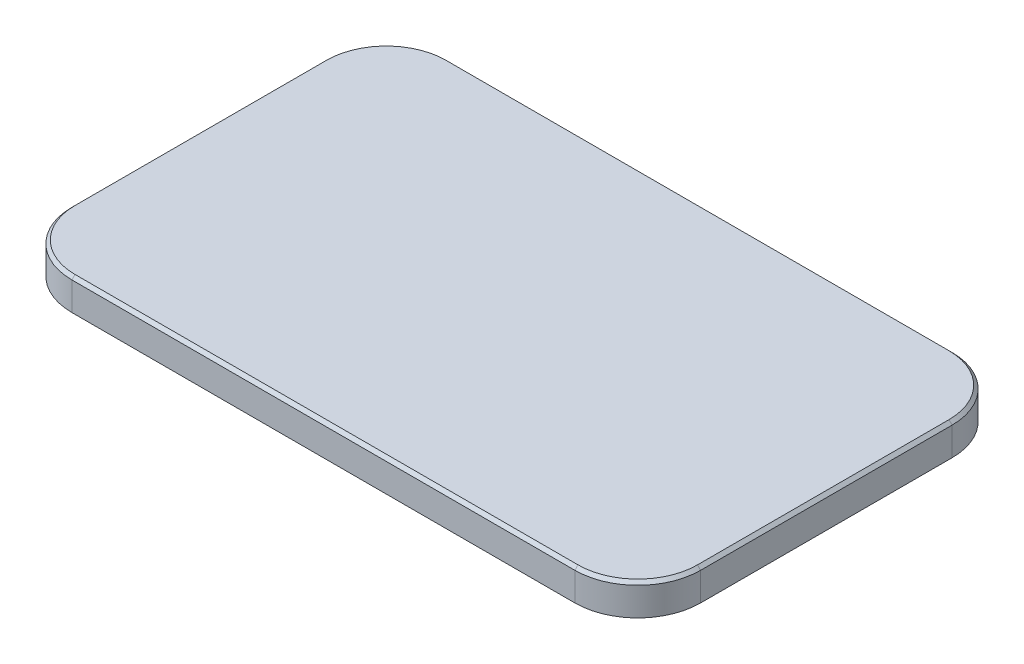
ISO-10303-21;
HEADER;
FILE_DESCRIPTION(('STEP AP214'),'2;1');
FILE_NAME('part.step','',(''),(''),'','','');
FILE_SCHEMA(('AUTOMOTIVE_DESIGN { 1 0 10303 214 1 1 1 1 }'));
ENDSEC;
DATA;
#1=APPLICATION_CONTEXT('core data for automotive mechanical design processes');
#2=APPLICATION_PROTOCOL_DEFINITION('international standard','automotive_design',2000,#1);
#3=PRODUCT_CONTEXT('',#1,'mechanical');
#4=PRODUCT('Part','Part','',(#3));
#5=PRODUCT_RELATED_PRODUCT_CATEGORY('part','',(#4));
#6=PRODUCT_DEFINITION_FORMATION('','',#4);
#7=PRODUCT_DEFINITION_CONTEXT('part definition',#1,'design');
#8=PRODUCT_DEFINITION('design','',#6,#7);
#9=PRODUCT_DEFINITION_SHAPE('','',#8);
#10=(LENGTH_UNIT() NAMED_UNIT(*) SI_UNIT(.MILLI.,.METRE.));
#11=(NAMED_UNIT(*) PLANE_ANGLE_UNIT() SI_UNIT($,.RADIAN.));
#12=(NAMED_UNIT(*) SI_UNIT($,.STERADIAN.) SOLID_ANGLE_UNIT());
#13=UNCERTAINTY_MEASURE_WITH_UNIT(LENGTH_MEASURE(1.E-05),#10,'distance_accuracy_value','');
#14=(GEOMETRIC_REPRESENTATION_CONTEXT(3) GLOBAL_UNCERTAINTY_ASSIGNED_CONTEXT((#13)) GLOBAL_UNIT_ASSIGNED_CONTEXT((#10,
#11,#12)) REPRESENTATION_CONTEXT('',''));
#15=CARTESIAN_POINT('',(0.,0.,0.));
#16=DIRECTION('',(0.,0.,1.));
#17=DIRECTION('',(1.,0.,0.));
#18=AXIS2_PLACEMENT_3D('',#15,#16,#17);
#19=CARTESIAN_POINT('',(-63.5,6.35,-38.1));
#20=DIRECTION('',(1.,0.,0.));
#21=DIRECTION('',(0.,0.,-1.));
#22=AXIS2_PLACEMENT_3D('',#19,#20,#21);
#23=PLANE('',#22);
#24=DIRECTION('',(0.,-1.,0.));
#25=VECTOR('',#24,1.);
#26=CARTESIAN_POINT('',(-63.5,6.35,25.4));
#27=LINE('',#26,#25);
#28=CARTESIAN_POINT('',(-63.5,0.,25.4));
#29=VERTEX_POINT('',#28);
#30=CARTESIAN_POINT('',(-63.5,5.715,25.4));
#31=VERTEX_POINT('',#30);
#32=EDGE_CURVE('E127',#29,#31,#27,.F.);
#33=ORIENTED_EDGE('',*,*,#32,.T.);
#34=DIRECTION('',(0.,0.,-1.));
#35=VECTOR('',#34,1.);
#36=CARTESIAN_POINT('',(-63.5,5.715,-25.4));
#37=LINE('',#36,#35);
#38=CARTESIAN_POINT('',(-63.5,5.715,-25.4));
#39=VERTEX_POINT('',#38);
#40=EDGE_CURVE('E55',#31,#39,#37,.T.);
#41=ORIENTED_EDGE('',*,*,#40,.T.);
#42=DIRECTION('',(0.,-1.,0.));
#43=VECTOR('',#42,1.);
#44=CARTESIAN_POINT('',(-63.5,6.35,-25.4));
#45=LINE('',#44,#43);
#46=CARTESIAN_POINT('',(-63.5,0.,-25.4));
#47=VERTEX_POINT('',#46);
#48=EDGE_CURVE('E120',#39,#47,#45,.T.);
#49=ORIENTED_EDGE('',*,*,#48,.T.);
#50=DIRECTION('',(0.,0.,1.));
#51=VECTOR('',#50,1.);
#52=CARTESIAN_POINT('',(-63.5,0.,-38.1));
#53=LINE('',#52,#51);
#54=EDGE_CURVE('E123',#47,#29,#53,.T.);
#55=ORIENTED_EDGE('',*,*,#54,.T.);
#56=EDGE_LOOP('',(#33,#41,#49,#55));
#57=FACE_BOUND('',#56,.T.);
#58=ADVANCED_FACE('F31',(#57),#23,.F.);
#59=CARTESIAN_POINT('',(-63.5,6.35,38.1));
#60=DIRECTION('',(0.,0.,-1.));
#61=DIRECTION('',(-1.,0.,0.));
#62=AXIS2_PLACEMENT_3D('',#59,#60,#61);
#63=PLANE('',#62);
#64=DIRECTION('',(0.,-1.,0.));
#65=VECTOR('',#64,1.);
#66=CARTESIAN_POINT('',(50.8,6.35,38.1));
#67=LINE('',#66,#65);
#68=CARTESIAN_POINT('',(50.8,0.,38.1));
#69=VERTEX_POINT('',#68);
#70=CARTESIAN_POINT('',(50.8,5.715,38.1));
#71=VERTEX_POINT('',#70);
#72=EDGE_CURVE('E165',#69,#71,#67,.F.);
#73=ORIENTED_EDGE('',*,*,#72,.T.);
#74=DIRECTION('',(-1.,0.,0.));
#75=VECTOR('',#74,1.);
#76=CARTESIAN_POINT('',(-50.8,5.715,38.1));
#77=LINE('',#76,#75);
#78=CARTESIAN_POINT('',(-50.8,5.715,38.1));
#79=VERTEX_POINT('',#78);
#80=EDGE_CURVE('E194',#71,#79,#77,.T.);
#81=ORIENTED_EDGE('',*,*,#80,.T.);
#82=DIRECTION('',(0.,-1.,0.));
#83=VECTOR('',#82,1.);
#84=CARTESIAN_POINT('',(-50.8,6.35,38.1));
#85=LINE('',#84,#83);
#86=CARTESIAN_POINT('',(-50.8,0.,38.1));
#87=VERTEX_POINT('',#86);
#88=EDGE_CURVE('E168',#79,#87,#85,.T.);
#89=ORIENTED_EDGE('',*,*,#88,.T.);
#90=DIRECTION('',(1.,0.,0.));
#91=VECTOR('',#90,1.);
#92=CARTESIAN_POINT('',(-63.5,0.,38.1));
#93=LINE('',#92,#91);
#94=EDGE_CURVE('E142',#87,#69,#93,.T.);
#95=ORIENTED_EDGE('',*,*,#94,.T.);
#96=EDGE_LOOP('',(#73,#81,#89,#95));
#97=FACE_BOUND('',#96,.T.);
#98=ADVANCED_FACE('F271',(#97),#63,.F.);
#99=CARTESIAN_POINT('',(63.5,6.35,-38.1));
#100=DIRECTION('',(-1.,0.,0.));
#101=DIRECTION('',(0.,0.,1.));
#102=AXIS2_PLACEMENT_3D('',#99,#100,#101);
#103=PLANE('',#102);
#104=DIRECTION('',(0.,-1.,0.));
#105=VECTOR('',#104,1.);
#106=CARTESIAN_POINT('',(63.5,6.35,-25.4));
#107=LINE('',#106,#105);
#108=CARTESIAN_POINT('',(63.5,0.,-25.4));
#109=VERTEX_POINT('',#108);
#110=CARTESIAN_POINT('',(63.5,5.715,-25.4));
#111=VERTEX_POINT('',#110);
#112=EDGE_CURVE('E162',#109,#111,#107,.F.);
#113=ORIENTED_EDGE('',*,*,#112,.T.);
#114=DIRECTION('',(0.,0.,1.));
#115=VECTOR('',#114,1.);
#116=CARTESIAN_POINT('',(63.5,5.715,25.4));
#117=LINE('',#116,#115);
#118=CARTESIAN_POINT('',(63.5,5.715,25.4));
#119=VERTEX_POINT('',#118);
#120=EDGE_CURVE('E190',#111,#119,#117,.T.);
#121=ORIENTED_EDGE('',*,*,#120,.T.);
#122=DIRECTION('',(0.,-1.,0.));
#123=VECTOR('',#122,1.);
#124=CARTESIAN_POINT('',(63.5,6.35,25.4));
#125=LINE('',#124,#123);
#126=CARTESIAN_POINT('',(63.5,0.,25.4));
#127=VERTEX_POINT('',#126);
#128=EDGE_CURVE('E160',#119,#127,#125,.T.);
#129=ORIENTED_EDGE('',*,*,#128,.T.);
#130=DIRECTION('',(0.,0.,-1.));
#131=VECTOR('',#130,1.);
#132=CARTESIAN_POINT('',(63.5,0.,-38.1));
#133=LINE('',#132,#131);
#134=EDGE_CURVE('E145',#127,#109,#133,.T.);
#135=ORIENTED_EDGE('',*,*,#134,.T.);
#136=EDGE_LOOP('',(#113,#121,#129,#135));
#137=FACE_BOUND('',#136,.T.);
#138=ADVANCED_FACE('F256',(#137),#103,.F.);
#139=CARTESIAN_POINT('',(-63.5,6.35,-38.1));
#140=DIRECTION('',(0.,0.,1.));
#141=DIRECTION('',(1.,0.,0.));
#142=AXIS2_PLACEMENT_3D('',#139,#140,#141);
#143=PLANE('',#142);
#144=DIRECTION('',(0.,-1.,0.));
#145=VECTOR('',#144,1.);
#146=CARTESIAN_POINT('',(-50.8,6.35,-38.1));
#147=LINE('',#146,#145);
#148=CARTESIAN_POINT('',(-50.8,0.,-38.1));
#149=VERTEX_POINT('',#148);
#150=CARTESIAN_POINT('',(-50.8,5.715,-38.1));
#151=VERTEX_POINT('',#150);
#152=EDGE_CURVE('E131',#149,#151,#147,.F.);
#153=ORIENTED_EDGE('',*,*,#152,.T.);
#154=DIRECTION('',(1.,0.,0.));
#155=VECTOR('',#154,1.);
#156=CARTESIAN_POINT('',(50.8,5.715,-38.1));
#157=LINE('',#156,#155);
#158=CARTESIAN_POINT('',(50.8,5.715,-38.1));
#159=VERTEX_POINT('',#158);
#160=EDGE_CURVE('E11',#151,#159,#157,.T.);
#161=ORIENTED_EDGE('',*,*,#160,.T.);
#162=DIRECTION('',(0.,-1.,0.));
#163=VECTOR('',#162,1.);
#164=CARTESIAN_POINT('',(50.8,6.35,-38.1));
#165=LINE('',#164,#163);
#166=CARTESIAN_POINT('',(50.8,0.,-38.1));
#167=VERTEX_POINT('',#166);
#168=EDGE_CURVE('E135',#159,#167,#165,.T.);
#169=ORIENTED_EDGE('',*,*,#168,.T.);
#170=DIRECTION('',(-1.,0.,0.));
#171=VECTOR('',#170,1.);
#172=CARTESIAN_POINT('',(-63.5,0.,-38.1));
#173=LINE('',#172,#171);
#174=EDGE_CURVE('E152',#167,#149,#173,.T.);
#175=ORIENTED_EDGE('',*,*,#174,.T.);
#176=EDGE_LOOP('',(#153,#161,#169,#175));
#177=FACE_BOUND('',#176,.T.);
#178=ADVANCED_FACE('F239',(#177),#143,.F.);
#179=CARTESIAN_POINT('',(-63.5,6.35,38.1));
#180=DIRECTION('',(0.,1.,0.));
#181=DIRECTION('',(0.,0.,1.));
#182=AXIS2_PLACEMENT_3D('',#179,#180,#181);
#183=PLANE('',#182);
#184=DIRECTION('',(0.,0.,-1.));
#185=VECTOR('',#184,1.);
#186=CARTESIAN_POINT('',(62.865,6.35,-25.4));
#187=LINE('',#186,#185);
#188=CARTESIAN_POINT('',(62.865,6.35,25.4));
#189=VERTEX_POINT('',#188);
#190=CARTESIAN_POINT('',(62.865,6.35,-25.4));
#191=VERTEX_POINT('',#190);
#192=EDGE_CURVE('E182',#189,#191,#187,.T.);
#193=ORIENTED_EDGE('',*,*,#192,.T.);
#194=CARTESIAN_POINT('',(50.8,6.35,-25.4));
#195=DIRECTION('',(0.,1.,0.));
#196=DIRECTION('',(0.,0.,1.));
#197=AXIS2_PLACEMENT_3D('',#194,#195,#196);
#198=CIRCLE('',#197,12.065);
#199=CARTESIAN_POINT('',(50.8,6.35,-37.465));
#200=VERTEX_POINT('',#199);
#201=EDGE_CURVE('E184',#191,#200,#198,.T.);
#202=ORIENTED_EDGE('',*,*,#201,.T.);
#203=DIRECTION('',(-1.,0.,0.));
#204=VECTOR('',#203,1.);
#205=CARTESIAN_POINT('',(-50.8,6.35,-37.465));
#206=LINE('',#205,#204);
#207=CARTESIAN_POINT('',(-50.8,6.35,-37.465));
#208=VERTEX_POINT('',#207);
#209=EDGE_CURVE('E170',#200,#208,#206,.T.);
#210=ORIENTED_EDGE('',*,*,#209,.T.);
#211=CARTESIAN_POINT('',(-50.8,6.35,-25.4));
#212=DIRECTION('',(0.,1.,0.));
#213=DIRECTION('',(0.,0.,1.));
#214=AXIS2_PLACEMENT_3D('',#211,#212,#213);
#215=CIRCLE('',#214,12.065);
#216=CARTESIAN_POINT('',(-62.865,6.35,-25.4));
#217=VERTEX_POINT('',#216);
#218=EDGE_CURVE('E172',#208,#217,#215,.T.);
#219=ORIENTED_EDGE('',*,*,#218,.T.);
#220=DIRECTION('',(0.,0.,1.));
#221=VECTOR('',#220,1.);
#222=CARTESIAN_POINT('',(-62.865,6.35,25.4));
#223=LINE('',#222,#221);
#224=CARTESIAN_POINT('',(-62.865,6.35,25.4));
#225=VERTEX_POINT('',#224);
#226=EDGE_CURVE('E174',#217,#225,#223,.T.);
#227=ORIENTED_EDGE('',*,*,#226,.T.);
#228=CARTESIAN_POINT('',(-50.8,6.35,25.4));
#229=DIRECTION('',(0.,1.,0.));
#230=DIRECTION('',(0.,0.,1.));
#231=AXIS2_PLACEMENT_3D('',#228,#229,#230);
#232=CIRCLE('',#231,12.065);
#233=CARTESIAN_POINT('',(-50.8,6.35,37.465));
#234=VERTEX_POINT('',#233);
#235=EDGE_CURVE('E176',#225,#234,#232,.T.);
#236=ORIENTED_EDGE('',*,*,#235,.T.);
#237=DIRECTION('',(1.,0.,0.));
#238=VECTOR('',#237,1.);
#239=CARTESIAN_POINT('',(50.8,6.35,37.465));
#240=LINE('',#239,#238);
#241=CARTESIAN_POINT('',(50.8,6.35,37.465));
#242=VERTEX_POINT('',#241);
#243=EDGE_CURVE('E178',#234,#242,#240,.T.);
#244=ORIENTED_EDGE('',*,*,#243,.T.);
#245=CARTESIAN_POINT('',(50.8,6.35,25.4));
#246=DIRECTION('',(0.,1.,0.));
#247=DIRECTION('',(0.,0.,1.));
#248=AXIS2_PLACEMENT_3D('',#245,#246,#247);
#249=CIRCLE('',#248,12.065);
#250=EDGE_CURVE('E180',#242,#189,#249,.T.);
#251=ORIENTED_EDGE('',*,*,#250,.T.);
#252=EDGE_LOOP('',(#193,#202,#210,#219,#227,#236,#244,#251));
#253=FACE_BOUND('',#252,.T.);
#254=ADVANCED_FACE('F226',(#253),#183,.T.);
#255=CARTESIAN_POINT('',(-63.5,0.,38.1));
#256=DIRECTION('',(0.,1.,0.));
#257=DIRECTION('',(0.,0.,1.));
#258=AXIS2_PLACEMENT_3D('',#255,#256,#257);
#259=PLANE('',#258);
#260=ORIENTED_EDGE('',*,*,#54,.F.);
#261=CARTESIAN_POINT('',(-50.8,0.,-25.4));
#262=DIRECTION('',(0.,1.,0.));
#263=DIRECTION('',(0.,0.,1.));
#264=AXIS2_PLACEMENT_3D('',#261,#262,#263);
#265=CIRCLE('',#264,12.7);
#266=EDGE_CURVE('E129',#47,#149,#265,.F.);
#267=ORIENTED_EDGE('',*,*,#266,.T.);
#268=ORIENTED_EDGE('',*,*,#174,.F.);
#269=CARTESIAN_POINT('',(50.8,0.,-25.4));
#270=DIRECTION('',(0.,1.,0.));
#271=DIRECTION('',(0.,0.,1.));
#272=AXIS2_PLACEMENT_3D('',#269,#270,#271);
#273=CIRCLE('',#272,12.7);
#274=EDGE_CURVE('E136',#167,#109,#273,.F.);
#275=ORIENTED_EDGE('',*,*,#274,.T.);
#276=ORIENTED_EDGE('',*,*,#134,.F.);
#277=CARTESIAN_POINT('',(50.8,0.,25.4));
#278=DIRECTION('',(0.,1.,0.));
#279=DIRECTION('',(0.,0.,1.));
#280=AXIS2_PLACEMENT_3D('',#277,#278,#279);
#281=CIRCLE('',#280,12.7);
#282=EDGE_CURVE('E126',#127,#69,#281,.F.);
#283=ORIENTED_EDGE('',*,*,#282,.T.);
#284=ORIENTED_EDGE('',*,*,#94,.F.);
#285=CARTESIAN_POINT('',(-50.8,0.,25.4));
#286=DIRECTION('',(0.,1.,0.));
#287=DIRECTION('',(0.,0.,1.));
#288=AXIS2_PLACEMENT_3D('',#285,#286,#287);
#289=CIRCLE('',#288,12.7);
#290=EDGE_CURVE('E141',#87,#29,#289,.F.);
#291=ORIENTED_EDGE('',*,*,#290,.T.);
#292=EDGE_LOOP('',(#260,#267,#268,#275,#276,#283,#284,#291));
#293=FACE_BOUND('',#292,.T.);
#294=ADVANCED_FACE('F138',(#293),#259,.F.);
#295=CARTESIAN_POINT('',(-50.8,6.35,-25.4));
#296=DIRECTION('',(0.,-1.,0.));
#297=DIRECTION('',(0.,0.,-1.));
#298=AXIS2_PLACEMENT_3D('',#295,#296,#297);
#299=CYLINDRICAL_SURFACE('',#298,12.7);
#300=ORIENTED_EDGE('',*,*,#48,.F.);
#301=CARTESIAN_POINT('',(-50.8,5.715,-25.4));
#302=DIRECTION('',(0.,1.,0.));
#303=DIRECTION('',(0.,0.,1.));
#304=AXIS2_PLACEMENT_3D('',#301,#302,#303);
#305=CIRCLE('',#304,12.7);
#306=EDGE_CURVE('E40',#39,#151,#305,.F.);
#307=ORIENTED_EDGE('',*,*,#306,.T.);
#308=ORIENTED_EDGE('',*,*,#152,.F.);
#309=ORIENTED_EDGE('',*,*,#266,.F.);
#310=EDGE_LOOP('',(#300,#307,#308,#309));
#311=FACE_BOUND('',#310,.T.);
#312=ADVANCED_FACE('F130',(#311),#299,.T.);
#313=CARTESIAN_POINT('',(50.8,6.35,-25.4));
#314=DIRECTION('',(0.,-1.,0.));
#315=DIRECTION('',(0.,0.,-1.));
#316=AXIS2_PLACEMENT_3D('',#313,#314,#315);
#317=CYLINDRICAL_SURFACE('',#316,12.7);
#318=ORIENTED_EDGE('',*,*,#168,.F.);
#319=CARTESIAN_POINT('',(50.8,5.715,-25.4));
#320=DIRECTION('',(0.,1.,0.));
#321=DIRECTION('',(0.,0.,1.));
#322=AXIS2_PLACEMENT_3D('',#319,#320,#321);
#323=CIRCLE('',#322,12.7);
#324=EDGE_CURVE('E187',#159,#111,#323,.F.);
#325=ORIENTED_EDGE('',*,*,#324,.T.);
#326=ORIENTED_EDGE('',*,*,#112,.F.);
#327=ORIENTED_EDGE('',*,*,#274,.F.);
#328=EDGE_LOOP('',(#318,#325,#326,#327));
#329=FACE_BOUND('',#328,.T.);
#330=ADVANCED_FACE('F243',(#329),#317,.T.);
#331=CARTESIAN_POINT('',(-50.8,6.35,25.4));
#332=DIRECTION('',(0.,-1.,0.));
#333=DIRECTION('',(0.,0.,-1.));
#334=AXIS2_PLACEMENT_3D('',#331,#332,#333);
#335=CYLINDRICAL_SURFACE('',#334,12.7);
#336=ORIENTED_EDGE('',*,*,#88,.F.);
#337=CARTESIAN_POINT('',(-50.8,5.715,25.4));
#338=DIRECTION('',(0.,1.,0.));
#339=DIRECTION('',(0.,0.,1.));
#340=AXIS2_PLACEMENT_3D('',#337,#338,#339);
#341=CIRCLE('',#340,12.7);
#342=EDGE_CURVE('E196',#79,#31,#341,.F.);
#343=ORIENTED_EDGE('',*,*,#342,.T.);
#344=ORIENTED_EDGE('',*,*,#32,.F.);
#345=ORIENTED_EDGE('',*,*,#290,.F.);
#346=EDGE_LOOP('',(#336,#343,#344,#345));
#347=FACE_BOUND('',#346,.T.);
#348=ADVANCED_FACE('F273',(#347),#335,.T.);
#349=CARTESIAN_POINT('',(50.8,6.35,25.4));
#350=DIRECTION('',(0.,-1.,0.));
#351=DIRECTION('',(0.,0.,-1.));
#352=AXIS2_PLACEMENT_3D('',#349,#350,#351);
#353=CYLINDRICAL_SURFACE('',#352,12.7);
#354=ORIENTED_EDGE('',*,*,#128,.F.);
#355=CARTESIAN_POINT('',(50.8,5.715,25.4));
#356=DIRECTION('',(0.,1.,0.));
#357=DIRECTION('',(0.,0.,1.));
#358=AXIS2_PLACEMENT_3D('',#355,#356,#357);
#359=CIRCLE('',#358,12.7);
#360=EDGE_CURVE('E192',#119,#71,#359,.F.);
#361=ORIENTED_EDGE('',*,*,#360,.T.);
#362=ORIENTED_EDGE('',*,*,#72,.F.);
#363=ORIENTED_EDGE('',*,*,#282,.F.);
#364=EDGE_LOOP('',(#354,#361,#362,#363));
#365=FACE_BOUND('',#364,.T.);
#366=ADVANCED_FACE('F260',(#365),#353,.T.);
#367=CARTESIAN_POINT('',(-50.8,6.35,25.4));
#368=DIRECTION('',(0.,-1.,0.));
#369=DIRECTION('',(0.,0.,-1.));
#370=AXIS2_PLACEMENT_3D('',#367,#368,#369);
#371=CONICAL_SURFACE('',#370,12.065,0.785398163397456);
#372=DIRECTION('',(0.707106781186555,0.70710678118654,0.));
#373=VECTOR('',#372,1.);
#374=CARTESIAN_POINT('',(-63.5,5.715,25.4));
#375=LINE('',#374,#373);
#376=EDGE_CURVE('E148',#31,#225,#375,.T.);
#377=ORIENTED_EDGE('',*,*,#376,.F.);
#378=ORIENTED_EDGE('',*,*,#342,.F.);
#379=DIRECTION('',(0.,-0.707106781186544,0.707106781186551));
#380=VECTOR('',#379,1.);
#381=CARTESIAN_POINT('',(-50.8,6.35,37.465));
#382=LINE('',#381,#380);
#383=EDGE_CURVE('E35',#234,#79,#382,.T.);
#384=ORIENTED_EDGE('',*,*,#383,.F.);
#385=ORIENTED_EDGE('',*,*,#235,.F.);
#386=EDGE_LOOP('',(#377,#378,#384,#385));
#387=FACE_BOUND('',#386,.T.);
#388=ADVANCED_FACE('F33',(#387),#371,.T.);
#389=CARTESIAN_POINT('',(-63.5,6.35,37.465));
#390=DIRECTION('',(0.,0.707106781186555,0.70710678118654));
#391=DIRECTION('',(0.,-0.70710678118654,0.707106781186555));
#392=AXIS2_PLACEMENT_3D('',#389,#390,#391);
#393=PLANE('',#392);
#394=ORIENTED_EDGE('',*,*,#383,.T.);
#395=ORIENTED_EDGE('',*,*,#80,.F.);
#396=DIRECTION('',(0.,-0.70710678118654,0.707106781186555));
#397=VECTOR('',#396,1.);
#398=CARTESIAN_POINT('',(50.8,6.35,37.465));
#399=LINE('',#398,#397);
#400=EDGE_CURVE('E213',#242,#71,#399,.T.);
#401=ORIENTED_EDGE('',*,*,#400,.F.);
#402=ORIENTED_EDGE('',*,*,#243,.F.);
#403=EDGE_LOOP('',(#394,#395,#401,#402));
#404=FACE_BOUND('',#403,.T.);
#405=ADVANCED_FACE('F268',(#404),#393,.T.);
#406=CARTESIAN_POINT('',(-62.865,6.35,38.1));
#407=DIRECTION('',(-0.70710678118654,0.707106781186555,0.));
#408=DIRECTION('',(-0.707106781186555,-0.70710678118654,0.));
#409=AXIS2_PLACEMENT_3D('',#406,#407,#408);
#410=PLANE('',#409);
#411=ORIENTED_EDGE('',*,*,#376,.T.);
#412=ORIENTED_EDGE('',*,*,#226,.F.);
#413=DIRECTION('',(0.707106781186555,0.70710678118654,0.));
#414=VECTOR('',#413,1.);
#415=CARTESIAN_POINT('',(-63.5,5.715,-25.4));
#416=LINE('',#415,#414);
#417=EDGE_CURVE('E210',#39,#217,#416,.T.);
#418=ORIENTED_EDGE('',*,*,#417,.F.);
#419=ORIENTED_EDGE('',*,*,#40,.F.);
#420=EDGE_LOOP('',(#411,#412,#418,#419));
#421=FACE_BOUND('',#420,.T.);
#422=ADVANCED_FACE('F219',(#421),#410,.T.);
#423=CARTESIAN_POINT('',(50.8,6.35,25.4));
#424=DIRECTION('',(0.,-1.,0.));
#425=DIRECTION('',(0.,0.,-1.));
#426=AXIS2_PLACEMENT_3D('',#423,#424,#425);
#427=CONICAL_SURFACE('',#426,12.065,0.785398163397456);
#428=ORIENTED_EDGE('',*,*,#400,.T.);
#429=ORIENTED_EDGE('',*,*,#360,.F.);
#430=DIRECTION('',(0.707106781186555,-0.70710678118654,0.));
#431=VECTOR('',#430,1.);
#432=CARTESIAN_POINT('',(62.865,6.35,25.4));
#433=LINE('',#432,#431);
#434=EDGE_CURVE('E207',#189,#119,#433,.T.);
#435=ORIENTED_EDGE('',*,*,#434,.F.);
#436=ORIENTED_EDGE('',*,*,#250,.F.);
#437=EDGE_LOOP('',(#428,#429,#435,#436));
#438=FACE_BOUND('',#437,.T.);
#439=ADVANCED_FACE('F264',(#438),#427,.T.);
#440=CARTESIAN_POINT('',(-50.8,6.35,-25.4));
#441=DIRECTION('',(0.,-1.,0.));
#442=DIRECTION('',(0.,0.,-1.));
#443=AXIS2_PLACEMENT_3D('',#440,#441,#442);
#444=CONICAL_SURFACE('',#443,12.065,0.785398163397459);
#445=ORIENTED_EDGE('',*,*,#417,.T.);
#446=ORIENTED_EDGE('',*,*,#218,.F.);
#447=DIRECTION('',(0.,0.70710678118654,0.707106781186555));
#448=VECTOR('',#447,1.);
#449=CARTESIAN_POINT('',(-50.8,5.715,-38.1));
#450=LINE('',#449,#448);
#451=EDGE_CURVE('E204',#151,#208,#450,.T.);
#452=ORIENTED_EDGE('',*,*,#451,.F.);
#453=ORIENTED_EDGE('',*,*,#306,.F.);
#454=EDGE_LOOP('',(#445,#446,#452,#453));
#455=FACE_BOUND('',#454,.T.);
#456=ADVANCED_FACE('F232',(#455),#444,.T.);
#457=CARTESIAN_POINT('',(62.865,6.35,38.1));
#458=DIRECTION('',(0.70710678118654,0.707106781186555,0.));
#459=DIRECTION('',(-0.707106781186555,0.70710678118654,0.));
#460=AXIS2_PLACEMENT_3D('',#457,#458,#459);
#461=PLANE('',#460);
#462=ORIENTED_EDGE('',*,*,#434,.T.);
#463=ORIENTED_EDGE('',*,*,#120,.F.);
#464=DIRECTION('',(0.707106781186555,-0.70710678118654,0.));
#465=VECTOR('',#464,1.);
#466=CARTESIAN_POINT('',(62.865,6.35,-25.4));
#467=LINE('',#466,#465);
#468=EDGE_CURVE('E202',#191,#111,#467,.T.);
#469=ORIENTED_EDGE('',*,*,#468,.F.);
#470=ORIENTED_EDGE('',*,*,#192,.F.);
#471=EDGE_LOOP('',(#462,#463,#469,#470));
#472=FACE_BOUND('',#471,.T.);
#473=ADVANCED_FACE('F252',(#472),#461,.T.);
#474=CARTESIAN_POINT('',(-63.5,6.35,-37.465));
#475=DIRECTION('',(0.,0.707106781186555,-0.70710678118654));
#476=DIRECTION('',(0.,0.70710678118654,0.707106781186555));
#477=AXIS2_PLACEMENT_3D('',#474,#475,#476);
#478=PLANE('',#477);
#479=ORIENTED_EDGE('',*,*,#451,.T.);
#480=ORIENTED_EDGE('',*,*,#209,.F.);
#481=DIRECTION('',(0.,0.70710678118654,0.707106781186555));
#482=VECTOR('',#481,1.);
#483=CARTESIAN_POINT('',(50.8,5.715,-38.1));
#484=LINE('',#483,#482);
#485=EDGE_CURVE('E200',#159,#200,#484,.T.);
#486=ORIENTED_EDGE('',*,*,#485,.F.);
#487=ORIENTED_EDGE('',*,*,#160,.F.);
#488=EDGE_LOOP('',(#479,#480,#486,#487));
#489=FACE_BOUND('',#488,.T.);
#490=ADVANCED_FACE('F235',(#489),#478,.T.);
#491=CARTESIAN_POINT('',(50.8,6.35,-25.4));
#492=DIRECTION('',(0.,-1.,0.));
#493=DIRECTION('',(0.,0.,-1.));
#494=AXIS2_PLACEMENT_3D('',#491,#492,#493);
#495=CONICAL_SURFACE('',#494,12.065,0.785398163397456);
#496=ORIENTED_EDGE('',*,*,#468,.T.);
#497=ORIENTED_EDGE('',*,*,#324,.F.);
#498=ORIENTED_EDGE('',*,*,#485,.T.);
#499=ORIENTED_EDGE('',*,*,#201,.F.);
#500=EDGE_LOOP('',(#496,#497,#498,#499));
#501=FACE_BOUND('',#500,.T.);
#502=ADVANCED_FACE('F246',(#501),#495,.T.);
#503=CLOSED_SHELL('',(#58,#98,#138,#178,#254,#294,#312,#330,#348,#366,#388,#405,#422,#439,#456,
#473,#490,#502));
#504=MANIFOLD_SOLID_BREP('B2',#503);
#505=ADVANCED_BREP_SHAPE_REPRESENTATION('',(#18,#504),#14);
#506=SHAPE_DEFINITION_REPRESENTATION(#9,#505);
ENDSEC;
END-ISO-10303-21;
